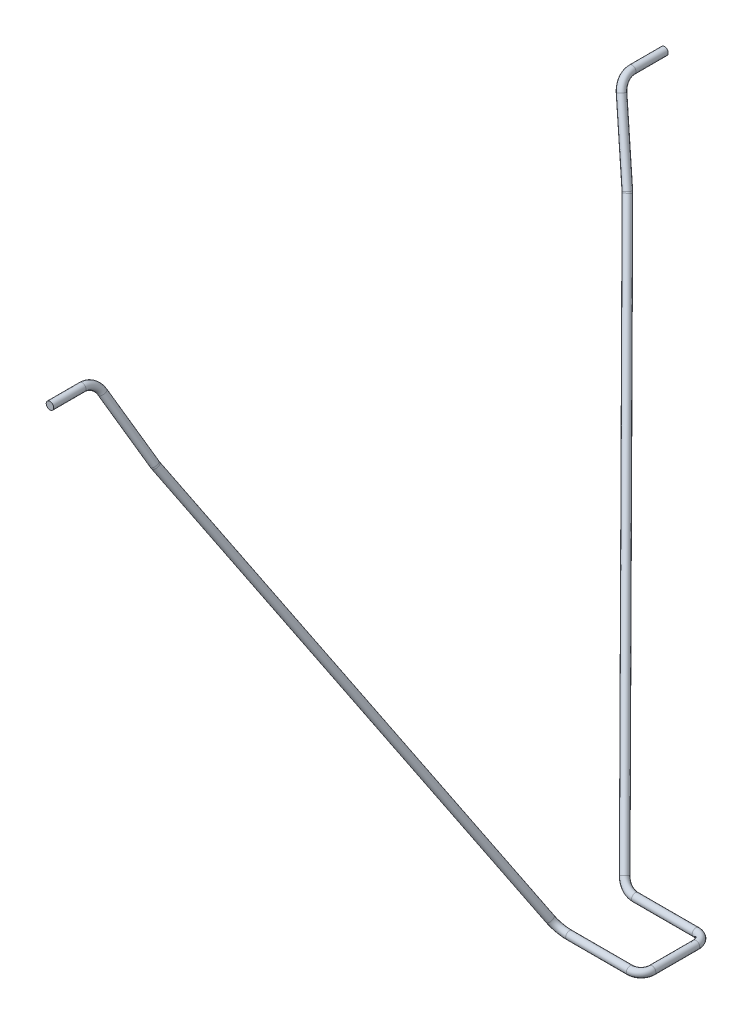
from build123d import *

# Parameters (mm, degrees)
ESQUISSE3_R = 0.685


with BuildPart() as part:
    # Balayage1: sweep along a curve in space
    with BuildLine() as balayage1_path:
        Line((0, 0, 0), (0, 0, 4))
        ThreePointArc((-2, 0, 6), (-0.585786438, 0, 5.414213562), (0, 0, 4))
        Line((-2, 0, 6), (-13.049187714, 0, 6))
        ThreePointArc((-13.049187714, 0, 6), (-14.684631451, 0.43310321, 6.218237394), (-15.791303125, 1.592381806, 6.80238901))
        Line((-15.791303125, 1.592381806, 6.80238901), (-51.453345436, 73.35702614, 42.964044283))
        ThreePointArc((-51.453345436, 73.35702614, 42.964044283), (-51.506741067, 73.464991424, 43.015273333), (-51.560666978, 73.575051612, 43.06121637))
        Line((-51.560666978, 73.575051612, 43.06121637), (-56.832008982, 84.382904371, 47.27288833))
        ThreePointArc((-57.712400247, 86.187973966, 50.104244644), (-57.469954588, 85.690886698, 48.36859321), (-56.832008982, 84.382904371, 47.27288833))
        Line((-57.712400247, 86.187973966, 50.104244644), (-57.712400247, 86.187973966, 55.979804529))
    # Esquisse3 → Balayage1 (sweep)
    with BuildSketch(Plane.XY):
        Circle(ESQUISSE3_R)
    balayage1 = sweep(path=balayage1_path.line)

    # Sym_trie2: Balayage1 across plane
    add(balayage1.mirror(Plane.XY))


solid = part.part
